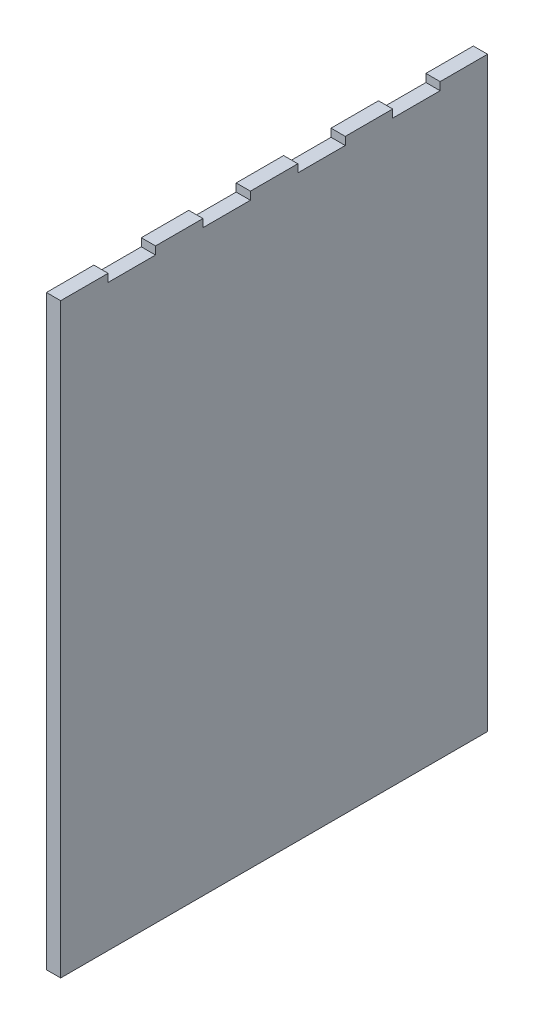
ISO-10303-21;
HEADER;
FILE_DESCRIPTION(('STEP AP214'),'2;1');
FILE_NAME('part.step','',(''),(''),'','','');
FILE_SCHEMA(('AUTOMOTIVE_DESIGN { 1 0 10303 214 1 1 1 1 }'));
ENDSEC;
DATA;
#1=APPLICATION_CONTEXT('core data for automotive mechanical design processes');
#2=APPLICATION_PROTOCOL_DEFINITION('international standard','automotive_design',2000,#1);
#3=PRODUCT_CONTEXT('',#1,'mechanical');
#4=PRODUCT('Part','Part','',(#3));
#5=PRODUCT_RELATED_PRODUCT_CATEGORY('part','',(#4));
#6=PRODUCT_DEFINITION_FORMATION('','',#4);
#7=PRODUCT_DEFINITION_CONTEXT('part definition',#1,'design');
#8=PRODUCT_DEFINITION('design','',#6,#7);
#9=PRODUCT_DEFINITION_SHAPE('','',#8);
#10=(LENGTH_UNIT() NAMED_UNIT(*) SI_UNIT(.MILLI.,.METRE.));
#11=(NAMED_UNIT(*) PLANE_ANGLE_UNIT() SI_UNIT($,.RADIAN.));
#12=(NAMED_UNIT(*) SI_UNIT($,.STERADIAN.) SOLID_ANGLE_UNIT());
#13=UNCERTAINTY_MEASURE_WITH_UNIT(LENGTH_MEASURE(1.E-05),#10,'distance_accuracy_value','');
#14=(GEOMETRIC_REPRESENTATION_CONTEXT(3) GLOBAL_UNCERTAINTY_ASSIGNED_CONTEXT((#13)) GLOBAL_UNIT_ASSIGNED_CONTEXT((#10,
#11,#12)) REPRESENTATION_CONTEXT('',''));
#15=CARTESIAN_POINT('',(0.,0.,0.));
#16=DIRECTION('',(0.,0.,1.));
#17=DIRECTION('',(1.,0.,0.));
#18=AXIS2_PLACEMENT_3D('',#15,#16,#17);
#19=CARTESIAN_POINT('',(18.,277.818652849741,532.497807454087));
#20=DIRECTION('',(0.,-1.,0.));
#21=DIRECTION('',(0.,0.,-1.));
#22=AXIS2_PLACEMENT_3D('',#19,#20,#21);
#23=PLANE('',#22);
#24=DIRECTION('',(0.,0.,1.));
#25=VECTOR('',#24,1.);
#26=CARTESIAN_POINT('',(18.,277.818652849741,532.497807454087));
#27=LINE('',#26,#25);
#28=CARTESIAN_POINT('',(18.,277.818652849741,172.497807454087));
#29=VERTEX_POINT('',#28);
#30=CARTESIAN_POINT('',(18.,277.818652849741,232.497807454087));
#31=VERTEX_POINT('',#30);
#32=EDGE_CURVE('E55',#29,#31,#27,.T.);
#33=ORIENTED_EDGE('',*,*,#32,.F.);
#34=DIRECTION('',(1.,0.,0.));
#35=VECTOR('',#34,1.);
#36=CARTESIAN_POINT('',(0.,277.818652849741,172.497807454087));
#37=LINE('',#36,#35);
#38=CARTESIAN_POINT('',(0.,277.818652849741,172.497807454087));
#39=VERTEX_POINT('',#38);
#40=EDGE_CURVE('E215',#39,#29,#37,.T.);
#41=ORIENTED_EDGE('',*,*,#40,.F.);
#42=DIRECTION('',(0.,0.,1.));
#43=VECTOR('',#42,1.);
#44=CARTESIAN_POINT('',(0.,277.818652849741,532.497807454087));
#45=LINE('',#44,#43);
#46=CARTESIAN_POINT('',(0.,277.818652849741,232.497807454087));
#47=VERTEX_POINT('',#46);
#48=EDGE_CURVE('E182',#39,#47,#45,.T.);
#49=ORIENTED_EDGE('',*,*,#48,.T.);
#50=DIRECTION('',(1.,0.,0.));
#51=VECTOR('',#50,1.);
#52=CARTESIAN_POINT('',(0.,277.818652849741,232.497807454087));
#53=LINE('',#52,#51);
#54=EDGE_CURVE('E254',#47,#31,#53,.T.);
#55=ORIENTED_EDGE('',*,*,#54,.T.);
#56=EDGE_LOOP('',(#33,#41,#49,#55));
#57=FACE_BOUND('',#56,.T.);
#58=ADVANCED_FACE('F32',(#57),#23,.F.);
#59=CARTESIAN_POINT('',(18.,277.818652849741,292.497807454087));
#60=VERTEX_POINT('',#59);
#61=CARTESIAN_POINT('',(18.,277.818652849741,352.497807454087));
#62=VERTEX_POINT('',#61);
#63=EDGE_CURVE('E366',#60,#62,#27,.T.);
#64=ORIENTED_EDGE('',*,*,#63,.F.);
#65=DIRECTION('',(1.,0.,0.));
#66=VECTOR('',#65,1.);
#67=CARTESIAN_POINT('',(0.,277.818652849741,292.497807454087));
#68=LINE('',#67,#66);
#69=CARTESIAN_POINT('',(0.,277.818652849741,292.497807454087));
#70=VERTEX_POINT('',#69);
#71=EDGE_CURVE('E241',#70,#60,#68,.T.);
#72=ORIENTED_EDGE('',*,*,#71,.F.);
#73=CARTESIAN_POINT('',(0.,277.818652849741,352.497807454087));
#74=VERTEX_POINT('',#73);
#75=EDGE_CURVE('E349',#70,#74,#45,.T.);
#76=ORIENTED_EDGE('',*,*,#75,.T.);
#77=DIRECTION('',(1.,0.,0.));
#78=VECTOR('',#77,1.);
#79=CARTESIAN_POINT('',(0.,277.818652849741,352.497807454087));
#80=LINE('',#79,#78);
#81=EDGE_CURVE('E281',#74,#62,#80,.T.);
#82=ORIENTED_EDGE('',*,*,#81,.T.);
#83=EDGE_LOOP('',(#64,#72,#76,#82));
#84=FACE_BOUND('',#83,.T.);
#85=ADVANCED_FACE('F378',(#84),#23,.F.);
#86=CARTESIAN_POINT('',(18.,277.818652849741,412.497807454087));
#87=VERTEX_POINT('',#86);
#88=CARTESIAN_POINT('',(18.,277.818652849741,472.497807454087));
#89=VERTEX_POINT('',#88);
#90=EDGE_CURVE('E312',#87,#89,#27,.T.);
#91=ORIENTED_EDGE('',*,*,#90,.F.);
#92=DIRECTION('',(1.,0.,0.));
#93=VECTOR('',#92,1.);
#94=CARTESIAN_POINT('',(0.,277.818652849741,412.497807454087));
#95=LINE('',#94,#93);
#96=CARTESIAN_POINT('',(0.,277.818652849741,412.497807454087));
#97=VERTEX_POINT('',#96);
#98=EDGE_CURVE('E268',#97,#87,#95,.T.);
#99=ORIENTED_EDGE('',*,*,#98,.F.);
#100=CARTESIAN_POINT('',(0.,277.818652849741,472.497807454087));
#101=VERTEX_POINT('',#100);
#102=EDGE_CURVE('E184',#97,#101,#45,.T.);
#103=ORIENTED_EDGE('',*,*,#102,.T.);
#104=DIRECTION('',(1.,0.,0.));
#105=VECTOR('',#104,1.);
#106=CARTESIAN_POINT('',(0.,277.818652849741,472.497807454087));
#107=LINE('',#106,#105);
#108=EDGE_CURVE('E293',#101,#89,#107,.T.);
#109=ORIENTED_EDGE('',*,*,#108,.T.);
#110=EDGE_LOOP('',(#91,#99,#103,#109));
#111=FACE_BOUND('',#110,.T.);
#112=ADVANCED_FACE('F346',(#111),#23,.F.);
#113=CARTESIAN_POINT('',(18.,277.818652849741,532.497807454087));
#114=DIRECTION('',(0.,0.,-1.));
#115=DIRECTION('',(-1.,0.,0.));
#116=AXIS2_PLACEMENT_3D('',#113,#114,#115);
#117=PLANE('',#116);
#118=DIRECTION('',(0.,-1.,0.));
#119=VECTOR('',#118,1.);
#120=CARTESIAN_POINT('',(0.,277.818652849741,532.497807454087));
#121=LINE('',#120,#119);
#122=CARTESIAN_POINT('',(0.,287.818652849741,532.497807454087));
#123=VERTEX_POINT('',#122);
#124=CARTESIAN_POINT('',(0.,-454.181347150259,532.497807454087));
#125=VERTEX_POINT('',#124);
#126=EDGE_CURVE('E301',#123,#125,#121,.T.);
#127=ORIENTED_EDGE('',*,*,#126,.T.);
#128=DIRECTION('',(-1.,0.,0.));
#129=VECTOR('',#128,1.);
#130=CARTESIAN_POINT('',(18.,-454.181347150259,532.497807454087));
#131=LINE('',#130,#129);
#132=CARTESIAN_POINT('',(18.,-454.181347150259,532.497807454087));
#133=VERTEX_POINT('',#132);
#134=EDGE_CURVE('E11',#133,#125,#131,.T.);
#135=ORIENTED_EDGE('',*,*,#134,.F.);
#136=DIRECTION('',(0.,-1.,0.));
#137=VECTOR('',#136,1.);
#138=CARTESIAN_POINT('',(18.,277.818652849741,532.497807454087));
#139=LINE('',#138,#137);
#140=CARTESIAN_POINT('',(18.,287.818652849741,532.497807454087));
#141=VERTEX_POINT('',#140);
#142=EDGE_CURVE('E181',#141,#133,#139,.T.);
#143=ORIENTED_EDGE('',*,*,#142,.F.);
#144=DIRECTION('',(1.,0.,0.));
#145=VECTOR('',#144,1.);
#146=CARTESIAN_POINT('',(0.,287.818652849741,532.497807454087));
#147=LINE('',#146,#145);
#148=EDGE_CURVE('E298',#123,#141,#147,.T.);
#149=ORIENTED_EDGE('',*,*,#148,.F.);
#150=EDGE_LOOP('',(#127,#135,#143,#149));
#151=FACE_BOUND('',#150,.T.);
#152=ADVANCED_FACE('F34',(#151),#117,.F.);
#153=CARTESIAN_POINT('',(18.,-454.181347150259,532.497807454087));
#154=DIRECTION('',(0.,1.,0.));
#155=DIRECTION('',(0.,0.,1.));
#156=AXIS2_PLACEMENT_3D('',#153,#154,#155);
#157=PLANE('',#156);
#158=DIRECTION('',(0.,0.,-1.));
#159=VECTOR('',#158,1.);
#160=CARTESIAN_POINT('',(0.,-454.181347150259,532.497807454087));
#161=LINE('',#160,#159);
#162=CARTESIAN_POINT('',(0.,-454.181347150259,-7.50219254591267));
#163=VERTEX_POINT('',#162);
#164=EDGE_CURVE('E316',#125,#163,#161,.T.);
#165=ORIENTED_EDGE('',*,*,#164,.T.);
#166=DIRECTION('',(-1.,0.,0.));
#167=VECTOR('',#166,1.);
#168=CARTESIAN_POINT('',(18.,-454.181347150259,-7.50219254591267));
#169=LINE('',#168,#167);
#170=CARTESIAN_POINT('',(18.,-454.181347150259,-7.50219254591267));
#171=VERTEX_POINT('',#170);
#172=EDGE_CURVE('E40',#171,#163,#169,.T.);
#173=ORIENTED_EDGE('',*,*,#172,.F.);
#174=DIRECTION('',(0.,0.,-1.));
#175=VECTOR('',#174,1.);
#176=CARTESIAN_POINT('',(18.,-454.181347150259,532.497807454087));
#177=LINE('',#176,#175);
#178=EDGE_CURVE('E308',#133,#171,#177,.T.);
#179=ORIENTED_EDGE('',*,*,#178,.F.);
#180=ORIENTED_EDGE('',*,*,#134,.T.);
#181=EDGE_LOOP('',(#165,#173,#179,#180));
#182=FACE_BOUND('',#181,.T.);
#183=ADVANCED_FACE('F333',(#182),#157,.F.);
#184=CARTESIAN_POINT('',(18.,277.818652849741,-7.50219254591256));
#185=DIRECTION('',(0.,0.,1.));
#186=DIRECTION('',(0.,-1.,0.));
#187=AXIS2_PLACEMENT_3D('',#184,#185,#186);
#188=PLANE('',#187);
#189=DIRECTION('',(0.,1.,0.));
#190=VECTOR('',#189,1.);
#191=CARTESIAN_POINT('',(0.,277.818652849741,-7.50219254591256));
#192=LINE('',#191,#190);
#193=CARTESIAN_POINT('',(0.,287.818652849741,-7.5021925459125));
#194=VERTEX_POINT('',#193);
#195=EDGE_CURVE('E318',#163,#194,#192,.T.);
#196=ORIENTED_EDGE('',*,*,#195,.T.);
#197=DIRECTION('',(1.,0.,0.));
#198=VECTOR('',#197,1.);
#199=CARTESIAN_POINT('',(0.,287.818652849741,-7.5021925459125));
#200=LINE('',#199,#198);
#201=CARTESIAN_POINT('',(18.,287.818652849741,-7.5021925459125));
#202=VERTEX_POINT('',#201);
#203=EDGE_CURVE('E190',#194,#202,#200,.T.);
#204=ORIENTED_EDGE('',*,*,#203,.T.);
#205=DIRECTION('',(0.,1.,0.));
#206=VECTOR('',#205,1.);
#207=CARTESIAN_POINT('',(18.,277.818652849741,-7.50219254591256));
#208=LINE('',#207,#206);
#209=EDGE_CURVE('E310',#171,#202,#208,.T.);
#210=ORIENTED_EDGE('',*,*,#209,.F.);
#211=ORIENTED_EDGE('',*,*,#172,.T.);
#212=EDGE_LOOP('',(#196,#204,#210,#211));
#213=FACE_BOUND('',#212,.T.);
#214=ADVANCED_FACE('F324',(#213),#188,.F.);
#215=CARTESIAN_POINT('',(18.,277.818652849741,52.4978074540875));
#216=VERTEX_POINT('',#215);
#217=CARTESIAN_POINT('',(18.,277.818652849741,112.497807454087));
#218=VERTEX_POINT('',#217);
#219=EDGE_CURVE('E47',#216,#218,#27,.T.);
#220=ORIENTED_EDGE('',*,*,#219,.F.);
#221=DIRECTION('',(1.,0.,0.));
#222=VECTOR('',#221,1.);
#223=CARTESIAN_POINT('',(0.,277.818652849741,52.4978074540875));
#224=LINE('',#223,#222);
#225=CARTESIAN_POINT('',(0.,277.818652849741,52.4978074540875));
#226=VERTEX_POINT('',#225);
#227=EDGE_CURVE('E185',#226,#216,#224,.T.);
#228=ORIENTED_EDGE('',*,*,#227,.F.);
#229=CARTESIAN_POINT('',(0.,277.818652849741,112.497807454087));
#230=VERTEX_POINT('',#229);
#231=EDGE_CURVE('E171',#226,#230,#45,.T.);
#232=ORIENTED_EDGE('',*,*,#231,.T.);
#233=DIRECTION('',(1.,0.,0.));
#234=VECTOR('',#233,1.);
#235=CARTESIAN_POINT('',(0.,277.818652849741,112.497807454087));
#236=LINE('',#235,#234);
#237=EDGE_CURVE('E228',#230,#218,#236,.T.);
#238=ORIENTED_EDGE('',*,*,#237,.T.);
#239=EDGE_LOOP('',(#220,#228,#232,#238));
#240=FACE_BOUND('',#239,.T.);
#241=ADVANCED_FACE('F186',(#240),#23,.F.);
#242=CARTESIAN_POINT('',(18.,0.,0.));
#243=DIRECTION('',(1.,0.,0.));
#244=DIRECTION('',(0.,0.,-1.));
#245=AXIS2_PLACEMENT_3D('',#242,#243,#244);
#246=PLANE('',#245);
#247=ORIENTED_EDGE('',*,*,#142,.T.);
#248=ORIENTED_EDGE('',*,*,#178,.T.);
#249=ORIENTED_EDGE('',*,*,#209,.T.);
#250=DIRECTION('',(0.,0.,1.));
#251=VECTOR('',#250,1.);
#252=CARTESIAN_POINT('',(18.,287.818652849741,52.4978074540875));
#253=LINE('',#252,#251);
#254=CARTESIAN_POINT('',(18.,287.818652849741,52.4978074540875));
#255=VERTEX_POINT('',#254);
#256=EDGE_CURVE('E195',#202,#255,#253,.T.);
#257=ORIENTED_EDGE('',*,*,#256,.T.);
#258=DIRECTION('',(0.,-1.,0.));
#259=VECTOR('',#258,1.);
#260=CARTESIAN_POINT('',(18.,277.818652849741,52.4978074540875));
#261=LINE('',#260,#259);
#262=EDGE_CURVE('E199',#255,#216,#261,.T.);
#263=ORIENTED_EDGE('',*,*,#262,.T.);
#264=ORIENTED_EDGE('',*,*,#219,.T.);
#265=DIRECTION('',(0.,1.,0.));
#266=VECTOR('',#265,1.);
#267=CARTESIAN_POINT('',(18.,277.818652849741,112.497807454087));
#268=LINE('',#267,#266);
#269=CARTESIAN_POINT('',(18.,287.818652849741,112.497807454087));
#270=VERTEX_POINT('',#269);
#271=EDGE_CURVE('E218',#218,#270,#268,.T.);
#272=ORIENTED_EDGE('',*,*,#271,.T.);
#273=DIRECTION('',(0.,0.,1.));
#274=VECTOR('',#273,1.);
#275=CARTESIAN_POINT('',(18.,287.818652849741,172.497807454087));
#276=LINE('',#275,#274);
#277=CARTESIAN_POINT('',(18.,287.818652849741,172.497807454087));
#278=VERTEX_POINT('',#277);
#279=EDGE_CURVE('E210',#270,#278,#276,.T.);
#280=ORIENTED_EDGE('',*,*,#279,.T.);
#281=DIRECTION('',(0.,-1.,0.));
#282=VECTOR('',#281,1.);
#283=CARTESIAN_POINT('',(18.,277.818652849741,172.497807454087));
#284=LINE('',#283,#282);
#285=EDGE_CURVE('E204',#278,#29,#284,.T.);
#286=ORIENTED_EDGE('',*,*,#285,.T.);
#287=ORIENTED_EDGE('',*,*,#32,.T.);
#288=DIRECTION('',(0.,1.,0.));
#289=VECTOR('',#288,1.);
#290=CARTESIAN_POINT('',(18.,277.818652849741,232.497807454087));
#291=LINE('',#290,#289);
#292=CARTESIAN_POINT('',(18.,287.818652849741,232.497807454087));
#293=VERTEX_POINT('',#292);
#294=EDGE_CURVE('E244',#31,#293,#291,.T.);
#295=ORIENTED_EDGE('',*,*,#294,.T.);
#296=DIRECTION('',(0.,0.,1.));
#297=VECTOR('',#296,1.);
#298=CARTESIAN_POINT('',(18.,287.818652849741,292.497807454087));
#299=LINE('',#298,#297);
#300=CARTESIAN_POINT('',(18.,287.818652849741,292.497807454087));
#301=VERTEX_POINT('',#300);
#302=EDGE_CURVE('E235',#293,#301,#299,.T.);
#303=ORIENTED_EDGE('',*,*,#302,.T.);
#304=DIRECTION('',(0.,-1.,0.));
#305=VECTOR('',#304,1.);
#306=CARTESIAN_POINT('',(18.,277.818652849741,292.497807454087));
#307=LINE('',#306,#305);
#308=EDGE_CURVE('E225',#301,#60,#307,.T.);
#309=ORIENTED_EDGE('',*,*,#308,.T.);
#310=ORIENTED_EDGE('',*,*,#63,.T.);
#311=DIRECTION('',(0.,1.,0.));
#312=VECTOR('',#311,1.);
#313=CARTESIAN_POINT('',(18.,277.818652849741,352.497807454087));
#314=LINE('',#313,#312);
#315=CARTESIAN_POINT('',(18.,287.818652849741,352.497807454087));
#316=VERTEX_POINT('',#315);
#317=EDGE_CURVE('E271',#62,#316,#314,.T.);
#318=ORIENTED_EDGE('',*,*,#317,.T.);
#319=DIRECTION('',(0.,0.,1.));
#320=VECTOR('',#319,1.);
#321=CARTESIAN_POINT('',(18.,287.818652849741,412.497807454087));
#322=LINE('',#321,#320);
#323=CARTESIAN_POINT('',(18.,287.818652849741,412.497807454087));
#324=VERTEX_POINT('',#323);
#325=EDGE_CURVE('E262',#316,#324,#322,.T.);
#326=ORIENTED_EDGE('',*,*,#325,.T.);
#327=DIRECTION('',(0.,-1.,0.));
#328=VECTOR('',#327,1.);
#329=CARTESIAN_POINT('',(18.,277.818652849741,412.497807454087));
#330=LINE('',#329,#328);
#331=EDGE_CURVE('E251',#324,#87,#330,.T.);
#332=ORIENTED_EDGE('',*,*,#331,.T.);
#333=ORIENTED_EDGE('',*,*,#90,.T.);
#334=DIRECTION('',(0.,1.,0.));
#335=VECTOR('',#334,1.);
#336=CARTESIAN_POINT('',(18.,277.818652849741,472.497807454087));
#337=LINE('',#336,#335);
#338=CARTESIAN_POINT('',(18.,287.818652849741,472.497807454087));
#339=VERTEX_POINT('',#338);
#340=EDGE_CURVE('E278',#89,#339,#337,.T.);
#341=ORIENTED_EDGE('',*,*,#340,.T.);
#342=DIRECTION('',(0.,0.,1.));
#343=VECTOR('',#342,1.);
#344=CARTESIAN_POINT('',(18.,287.818652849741,532.497807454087));
#345=LINE('',#344,#343);
#346=EDGE_CURVE('E290',#339,#141,#345,.T.);
#347=ORIENTED_EDGE('',*,*,#346,.T.);
#348=EDGE_LOOP('',(#247,#248,#249,#257,#263,#264,#272,#280,#286,#287,#295,#303,#309,#310,#318,
#326,#332,#333,#341,#347));
#349=FACE_BOUND('',#348,.T.);
#350=ADVANCED_FACE('F331',(#349),#246,.T.);
#351=CARTESIAN_POINT('',(0.,0.,0.));
#352=DIRECTION('',(1.,0.,0.));
#353=DIRECTION('',(0.,0.,-1.));
#354=AXIS2_PLACEMENT_3D('',#351,#352,#353);
#355=PLANE('',#354);
#356=ORIENTED_EDGE('',*,*,#126,.F.);
#357=DIRECTION('',(0.,0.,1.));
#358=VECTOR('',#357,1.);
#359=CARTESIAN_POINT('',(0.,287.818652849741,532.497807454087));
#360=LINE('',#359,#358);
#361=CARTESIAN_POINT('',(0.,287.818652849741,472.497807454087));
#362=VERTEX_POINT('',#361);
#363=EDGE_CURVE('E289',#362,#123,#360,.T.);
#364=ORIENTED_EDGE('',*,*,#363,.F.);
#365=DIRECTION('',(0.,1.,0.));
#366=VECTOR('',#365,1.);
#367=CARTESIAN_POINT('',(0.,277.818652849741,472.497807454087));
#368=LINE('',#367,#366);
#369=EDGE_CURVE('E286',#101,#362,#368,.T.);
#370=ORIENTED_EDGE('',*,*,#369,.F.);
#371=ORIENTED_EDGE('',*,*,#102,.F.);
#372=DIRECTION('',(0.,-1.,0.));
#373=VECTOR('',#372,1.);
#374=CARTESIAN_POINT('',(0.,277.818652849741,412.497807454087));
#375=LINE('',#374,#373);
#376=CARTESIAN_POINT('',(0.,287.818652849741,412.497807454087));
#377=VERTEX_POINT('',#376);
#378=EDGE_CURVE('E258',#377,#97,#375,.T.);
#379=ORIENTED_EDGE('',*,*,#378,.F.);
#380=DIRECTION('',(0.,0.,1.));
#381=VECTOR('',#380,1.);
#382=CARTESIAN_POINT('',(0.,287.818652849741,412.497807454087));
#383=LINE('',#382,#381);
#384=CARTESIAN_POINT('',(0.,287.818652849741,352.497807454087));
#385=VERTEX_POINT('',#384);
#386=EDGE_CURVE('E265',#385,#377,#383,.T.);
#387=ORIENTED_EDGE('',*,*,#386,.F.);
#388=DIRECTION('',(0.,1.,0.));
#389=VECTOR('',#388,1.);
#390=CARTESIAN_POINT('',(0.,277.818652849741,352.497807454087));
#391=LINE('',#390,#389);
#392=EDGE_CURVE('E261',#74,#385,#391,.T.);
#393=ORIENTED_EDGE('',*,*,#392,.F.);
#394=ORIENTED_EDGE('',*,*,#75,.F.);
#395=DIRECTION('',(0.,-1.,0.));
#396=VECTOR('',#395,1.);
#397=CARTESIAN_POINT('',(0.,277.818652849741,292.497807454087));
#398=LINE('',#397,#396);
#399=CARTESIAN_POINT('',(0.,287.818652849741,292.497807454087));
#400=VERTEX_POINT('',#399);
#401=EDGE_CURVE('E231',#400,#70,#398,.T.);
#402=ORIENTED_EDGE('',*,*,#401,.F.);
#403=DIRECTION('',(0.,0.,1.));
#404=VECTOR('',#403,1.);
#405=CARTESIAN_POINT('',(0.,287.818652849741,292.497807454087));
#406=LINE('',#405,#404);
#407=CARTESIAN_POINT('',(0.,287.818652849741,232.497807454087));
#408=VERTEX_POINT('',#407);
#409=EDGE_CURVE('E238',#408,#400,#406,.T.);
#410=ORIENTED_EDGE('',*,*,#409,.F.);
#411=DIRECTION('',(0.,1.,0.));
#412=VECTOR('',#411,1.);
#413=CARTESIAN_POINT('',(0.,277.818652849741,232.497807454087));
#414=LINE('',#413,#412);
#415=EDGE_CURVE('E234',#47,#408,#414,.T.);
#416=ORIENTED_EDGE('',*,*,#415,.F.);
#417=ORIENTED_EDGE('',*,*,#48,.F.);
#418=DIRECTION('',(0.,-1.,0.));
#419=VECTOR('',#418,1.);
#420=CARTESIAN_POINT('',(0.,277.818652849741,172.497807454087));
#421=LINE('',#420,#419);
#422=CARTESIAN_POINT('',(0.,287.818652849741,172.497807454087));
#423=VERTEX_POINT('',#422);
#424=EDGE_CURVE('E207',#423,#39,#421,.T.);
#425=ORIENTED_EDGE('',*,*,#424,.F.);
#426=DIRECTION('',(0.,0.,1.));
#427=VECTOR('',#426,1.);
#428=CARTESIAN_POINT('',(0.,287.818652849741,172.497807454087));
#429=LINE('',#428,#427);
#430=CARTESIAN_POINT('',(0.,287.818652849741,112.497807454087));
#431=VERTEX_POINT('',#430);
#432=EDGE_CURVE('E212',#431,#423,#429,.T.);
#433=ORIENTED_EDGE('',*,*,#432,.F.);
#434=DIRECTION('',(0.,1.,0.));
#435=VECTOR('',#434,1.);
#436=CARTESIAN_POINT('',(0.,277.818652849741,112.497807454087));
#437=LINE('',#436,#435);
#438=EDGE_CURVE('E179',#230,#431,#437,.T.);
#439=ORIENTED_EDGE('',*,*,#438,.F.);
#440=ORIENTED_EDGE('',*,*,#231,.F.);
#441=DIRECTION('',(0.,-1.,0.));
#442=VECTOR('',#441,1.);
#443=CARTESIAN_POINT('',(0.,277.818652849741,52.4978074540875));
#444=LINE('',#443,#442);
#445=CARTESIAN_POINT('',(0.,287.818652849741,52.4978074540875));
#446=VERTEX_POINT('',#445);
#447=EDGE_CURVE('E175',#446,#226,#444,.T.);
#448=ORIENTED_EDGE('',*,*,#447,.F.);
#449=DIRECTION('',(0.,0.,1.));
#450=VECTOR('',#449,1.);
#451=CARTESIAN_POINT('',(0.,287.818652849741,52.4978074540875));
#452=LINE('',#451,#450);
#453=EDGE_CURVE('E191',#194,#446,#452,.T.);
#454=ORIENTED_EDGE('',*,*,#453,.F.);
#455=ORIENTED_EDGE('',*,*,#195,.F.);
#456=ORIENTED_EDGE('',*,*,#164,.F.);
#457=EDGE_LOOP('',(#356,#364,#370,#371,#379,#387,#393,#394,#402,#410,#416,#417,#425,#433,#439,
#440,#448,#454,#455,#456));
#458=FACE_BOUND('',#457,.T.);
#459=ADVANCED_FACE('F172',(#458),#355,.F.);
#460=CARTESIAN_POINT('',(0.,287.818652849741,532.497807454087));
#461=DIRECTION('',(0.,1.,0.));
#462=DIRECTION('',(0.,0.,1.));
#463=AXIS2_PLACEMENT_3D('',#460,#461,#462);
#464=PLANE('',#463);
#465=ORIENTED_EDGE('',*,*,#346,.F.);
#466=DIRECTION('',(1.,0.,0.));
#467=VECTOR('',#466,1.);
#468=CARTESIAN_POINT('',(0.,287.818652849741,472.497807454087));
#469=LINE('',#468,#467);
#470=EDGE_CURVE('E302',#362,#339,#469,.T.);
#471=ORIENTED_EDGE('',*,*,#470,.F.);
#472=ORIENTED_EDGE('',*,*,#363,.T.);
#473=ORIENTED_EDGE('',*,*,#148,.T.);
#474=EDGE_LOOP('',(#465,#471,#472,#473));
#475=FACE_BOUND('',#474,.T.);
#476=ADVANCED_FACE('F340',(#475),#464,.T.);
#477=CARTESIAN_POINT('',(0.,277.818652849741,472.497807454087));
#478=DIRECTION('',(0.,0.,-1.));
#479=DIRECTION('',(-1.,0.,0.));
#480=AXIS2_PLACEMENT_3D('',#477,#478,#479);
#481=PLANE('',#480);
#482=ORIENTED_EDGE('',*,*,#340,.F.);
#483=ORIENTED_EDGE('',*,*,#108,.F.);
#484=ORIENTED_EDGE('',*,*,#369,.T.);
#485=ORIENTED_EDGE('',*,*,#470,.T.);
#486=EDGE_LOOP('',(#482,#483,#484,#485));
#487=FACE_BOUND('',#486,.T.);
#488=ADVANCED_FACE('F344',(#487),#481,.T.);
#489=CARTESIAN_POINT('',(0.,277.818652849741,412.497807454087));
#490=DIRECTION('',(0.,0.,1.));
#491=DIRECTION('',(1.,0.,0.));
#492=AXIS2_PLACEMENT_3D('',#489,#490,#491);
#493=PLANE('',#492);
#494=ORIENTED_EDGE('',*,*,#331,.F.);
#495=DIRECTION('',(1.,0.,0.));
#496=VECTOR('',#495,1.);
#497=CARTESIAN_POINT('',(0.,287.818652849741,412.497807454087));
#498=LINE('',#497,#496);
#499=EDGE_CURVE('E276',#377,#324,#498,.T.);
#500=ORIENTED_EDGE('',*,*,#499,.F.);
#501=ORIENTED_EDGE('',*,*,#378,.T.);
#502=ORIENTED_EDGE('',*,*,#98,.T.);
#503=EDGE_LOOP('',(#494,#500,#501,#502));
#504=FACE_BOUND('',#503,.T.);
#505=ADVANCED_FACE('F370',(#504),#493,.T.);
#506=CARTESIAN_POINT('',(0.,287.818652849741,412.497807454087));
#507=DIRECTION('',(0.,1.,0.));
#508=DIRECTION('',(0.,0.,1.));
#509=AXIS2_PLACEMENT_3D('',#506,#507,#508);
#510=PLANE('',#509);
#511=ORIENTED_EDGE('',*,*,#325,.F.);
#512=DIRECTION('',(1.,0.,0.));
#513=VECTOR('',#512,1.);
#514=CARTESIAN_POINT('',(0.,287.818652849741,352.497807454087));
#515=LINE('',#514,#513);
#516=EDGE_CURVE('E279',#385,#316,#515,.T.);
#517=ORIENTED_EDGE('',*,*,#516,.F.);
#518=ORIENTED_EDGE('',*,*,#386,.T.);
#519=ORIENTED_EDGE('',*,*,#499,.T.);
#520=EDGE_LOOP('',(#511,#517,#518,#519));
#521=FACE_BOUND('',#520,.T.);
#522=ADVANCED_FACE('F374',(#521),#510,.T.);
#523=CARTESIAN_POINT('',(0.,277.818652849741,352.497807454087));
#524=DIRECTION('',(0.,0.,-1.));
#525=DIRECTION('',(-1.,0.,0.));
#526=AXIS2_PLACEMENT_3D('',#523,#524,#525);
#527=PLANE('',#526);
#528=ORIENTED_EDGE('',*,*,#317,.F.);
#529=ORIENTED_EDGE('',*,*,#81,.F.);
#530=ORIENTED_EDGE('',*,*,#392,.T.);
#531=ORIENTED_EDGE('',*,*,#516,.T.);
#532=EDGE_LOOP('',(#528,#529,#530,#531));
#533=FACE_BOUND('',#532,.T.);
#534=ADVANCED_FACE('F377',(#533),#527,.T.);
#535=CARTESIAN_POINT('',(0.,277.818652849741,292.497807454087));
#536=DIRECTION('',(0.,0.,1.));
#537=DIRECTION('',(1.,0.,0.));
#538=AXIS2_PLACEMENT_3D('',#535,#536,#537);
#539=PLANE('',#538);
#540=ORIENTED_EDGE('',*,*,#308,.F.);
#541=DIRECTION('',(1.,0.,0.));
#542=VECTOR('',#541,1.);
#543=CARTESIAN_POINT('',(0.,287.818652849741,292.497807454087));
#544=LINE('',#543,#542);
#545=EDGE_CURVE('E249',#400,#301,#544,.T.);
#546=ORIENTED_EDGE('',*,*,#545,.F.);
#547=ORIENTED_EDGE('',*,*,#401,.T.);
#548=ORIENTED_EDGE('',*,*,#71,.T.);
#549=EDGE_LOOP('',(#540,#546,#547,#548));
#550=FACE_BOUND('',#549,.T.);
#551=ADVANCED_FACE('F380',(#550),#539,.T.);
#552=CARTESIAN_POINT('',(0.,287.818652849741,292.497807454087));
#553=DIRECTION('',(0.,1.,0.));
#554=DIRECTION('',(0.,0.,1.));
#555=AXIS2_PLACEMENT_3D('',#552,#553,#554);
#556=PLANE('',#555);
#557=ORIENTED_EDGE('',*,*,#302,.F.);
#558=DIRECTION('',(1.,0.,0.));
#559=VECTOR('',#558,1.);
#560=CARTESIAN_POINT('',(0.,287.818652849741,232.497807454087));
#561=LINE('',#560,#559);
#562=EDGE_CURVE('E252',#408,#293,#561,.T.);
#563=ORIENTED_EDGE('',*,*,#562,.F.);
#564=ORIENTED_EDGE('',*,*,#409,.T.);
#565=ORIENTED_EDGE('',*,*,#545,.T.);
#566=EDGE_LOOP('',(#557,#563,#564,#565));
#567=FACE_BOUND('',#566,.T.);
#568=ADVANCED_FACE('F363',(#567),#556,.T.);
#569=CARTESIAN_POINT('',(0.,277.818652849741,232.497807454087));
#570=DIRECTION('',(0.,0.,-1.));
#571=DIRECTION('',(-1.,0.,0.));
#572=AXIS2_PLACEMENT_3D('',#569,#570,#571);
#573=PLANE('',#572);
#574=ORIENTED_EDGE('',*,*,#294,.F.);
#575=ORIENTED_EDGE('',*,*,#54,.F.);
#576=ORIENTED_EDGE('',*,*,#415,.T.);
#577=ORIENTED_EDGE('',*,*,#562,.T.);
#578=EDGE_LOOP('',(#574,#575,#576,#577));
#579=FACE_BOUND('',#578,.T.);
#580=ADVANCED_FACE('F358',(#579),#573,.T.);
#581=CARTESIAN_POINT('',(0.,277.818652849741,172.497807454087));
#582=DIRECTION('',(0.,0.,1.));
#583=DIRECTION('',(1.,0.,0.));
#584=AXIS2_PLACEMENT_3D('',#581,#582,#583);
#585=PLANE('',#584);
#586=ORIENTED_EDGE('',*,*,#285,.F.);
#587=DIRECTION('',(1.,0.,0.));
#588=VECTOR('',#587,1.);
#589=CARTESIAN_POINT('',(0.,287.818652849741,172.497807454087));
#590=LINE('',#589,#588);
#591=EDGE_CURVE('E223',#423,#278,#590,.T.);
#592=ORIENTED_EDGE('',*,*,#591,.F.);
#593=ORIENTED_EDGE('',*,*,#424,.T.);
#594=ORIENTED_EDGE('',*,*,#40,.T.);
#595=EDGE_LOOP('',(#586,#592,#593,#594));
#596=FACE_BOUND('',#595,.T.);
#597=ADVANCED_FACE('F484',(#596),#585,.T.);
#598=CARTESIAN_POINT('',(0.,287.818652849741,172.497807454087));
#599=DIRECTION('',(0.,1.,0.));
#600=DIRECTION('',(0.,0.,1.));
#601=AXIS2_PLACEMENT_3D('',#598,#599,#600);
#602=PLANE('',#601);
#603=ORIENTED_EDGE('',*,*,#279,.F.);
#604=DIRECTION('',(1.,0.,0.));
#605=VECTOR('',#604,1.);
#606=CARTESIAN_POINT('',(0.,287.818652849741,112.497807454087));
#607=LINE('',#606,#605);
#608=EDGE_CURVE('E226',#431,#270,#607,.T.);
#609=ORIENTED_EDGE('',*,*,#608,.F.);
#610=ORIENTED_EDGE('',*,*,#432,.T.);
#611=ORIENTED_EDGE('',*,*,#591,.T.);
#612=EDGE_LOOP('',(#603,#609,#610,#611));
#613=FACE_BOUND('',#612,.T.);
#614=ADVANCED_FACE('F492',(#613),#602,.T.);
#615=CARTESIAN_POINT('',(0.,277.818652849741,112.497807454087));
#616=DIRECTION('',(0.,0.,-1.));
#617=DIRECTION('',(-1.,0.,0.));
#618=AXIS2_PLACEMENT_3D('',#615,#616,#617);
#619=PLANE('',#618);
#620=ORIENTED_EDGE('',*,*,#271,.F.);
#621=ORIENTED_EDGE('',*,*,#237,.F.);
#622=ORIENTED_EDGE('',*,*,#438,.T.);
#623=ORIENTED_EDGE('',*,*,#608,.T.);
#624=EDGE_LOOP('',(#620,#621,#622,#623));
#625=FACE_BOUND('',#624,.T.);
#626=ADVANCED_FACE('F502',(#625),#619,.T.);
#627=CARTESIAN_POINT('',(0.,277.818652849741,52.4978074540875));
#628=DIRECTION('',(0.,0.,1.));
#629=DIRECTION('',(1.,0.,0.));
#630=AXIS2_PLACEMENT_3D('',#627,#628,#629);
#631=PLANE('',#630);
#632=ORIENTED_EDGE('',*,*,#262,.F.);
#633=DIRECTION('',(1.,0.,0.));
#634=VECTOR('',#633,1.);
#635=CARTESIAN_POINT('',(0.,287.818652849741,52.4978074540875));
#636=LINE('',#635,#634);
#637=EDGE_CURVE('E194',#446,#255,#636,.T.);
#638=ORIENTED_EDGE('',*,*,#637,.F.);
#639=ORIENTED_EDGE('',*,*,#447,.T.);
#640=ORIENTED_EDGE('',*,*,#227,.T.);
#641=EDGE_LOOP('',(#632,#638,#639,#640));
#642=FACE_BOUND('',#641,.T.);
#643=ADVANCED_FACE('F193',(#642),#631,.T.);
#644=CARTESIAN_POINT('',(0.,287.818652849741,52.4978074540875));
#645=DIRECTION('',(0.,1.,0.));
#646=DIRECTION('',(0.,0.,1.));
#647=AXIS2_PLACEMENT_3D('',#644,#645,#646);
#648=PLANE('',#647);
#649=ORIENTED_EDGE('',*,*,#256,.F.);
#650=ORIENTED_EDGE('',*,*,#203,.F.);
#651=ORIENTED_EDGE('',*,*,#453,.T.);
#652=ORIENTED_EDGE('',*,*,#637,.T.);
#653=EDGE_LOOP('',(#649,#650,#651,#652));
#654=FACE_BOUND('',#653,.T.);
#655=ADVANCED_FACE('F329',(#654),#648,.T.);
#656=CLOSED_SHELL('',(#58,#85,#112,#152,#183,#214,#241,#350,#459,#476,#488,#505,#522,#534,#551,
#568,#580,#597,#614,#626,#643,#655));
#657=MANIFOLD_SOLID_BREP('B2',#656);
#658=ADVANCED_BREP_SHAPE_REPRESENTATION('',(#18,#657),#14);
#659=SHAPE_DEFINITION_REPRESENTATION(#9,#658);
ENDSEC;
END-ISO-10303-21;
